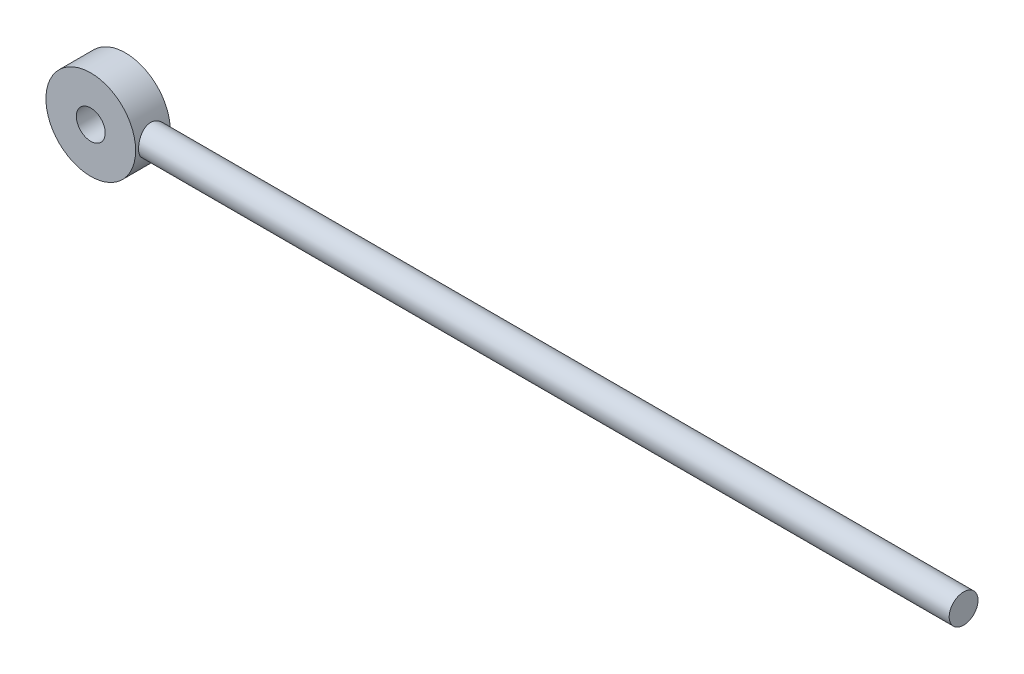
ISO-10303-21;
HEADER;
FILE_DESCRIPTION(('STEP AP214'),'2;1');
FILE_NAME('part.step','',(''),(''),'','','');
FILE_SCHEMA(('AUTOMOTIVE_DESIGN { 1 0 10303 214 1 1 1 1 }'));
ENDSEC;
DATA;
#1=APPLICATION_CONTEXT('core data for automotive mechanical design processes');
#2=APPLICATION_PROTOCOL_DEFINITION('international standard','automotive_design',2000,#1);
#3=PRODUCT_CONTEXT('',#1,'mechanical');
#4=PRODUCT('Part','Part','',(#3));
#5=PRODUCT_RELATED_PRODUCT_CATEGORY('part','',(#4));
#6=PRODUCT_DEFINITION_FORMATION('','',#4);
#7=PRODUCT_DEFINITION_CONTEXT('part definition',#1,'design');
#8=PRODUCT_DEFINITION('design','',#6,#7);
#9=PRODUCT_DEFINITION_SHAPE('','',#8);
#10=(LENGTH_UNIT() NAMED_UNIT(*) SI_UNIT(.MILLI.,.METRE.));
#11=(NAMED_UNIT(*) PLANE_ANGLE_UNIT() SI_UNIT($,.RADIAN.));
#12=(NAMED_UNIT(*) SI_UNIT($,.STERADIAN.) SOLID_ANGLE_UNIT());
#13=UNCERTAINTY_MEASURE_WITH_UNIT(LENGTH_MEASURE(1.E-05),#10,'distance_accuracy_value','');
#14=(GEOMETRIC_REPRESENTATION_CONTEXT(3) GLOBAL_UNCERTAINTY_ASSIGNED_CONTEXT((#13)) GLOBAL_UNIT_ASSIGNED_CONTEXT((#10,
#11,#12)) REPRESENTATION_CONTEXT('',''));
#15=CARTESIAN_POINT('',(0.,0.,0.));
#16=DIRECTION('',(0.,0.,1.));
#17=DIRECTION('',(1.,0.,0.));
#18=AXIS2_PLACEMENT_3D('',#15,#16,#17);
#19=CARTESIAN_POINT('',(11.6643537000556,0.,0.));
#20=DIRECTION('',(-1.,0.,0.));
#21=DIRECTION('',(0.,0.,1.));
#22=AXIS2_PLACEMENT_3D('',#19,#20,#21);
#23=CYLINDRICAL_SURFACE('',#22,3.9624);
#24=CARTESIAN_POINT('',(234.95,0.,0.));
#25=DIRECTION('',(-1.,0.,0.));
#26=DIRECTION('',(0.,0.,1.));
#27=AXIS2_PLACEMENT_3D('',#24,#25,#26);
#28=CIRCLE('',#27,3.9624);
#29=CARTESIAN_POINT('',(234.95,0.,3.9624));
#30=VERTEX_POINT('',#29);
#31=EDGE_CURVE('E41',#30,#30,#28,.T.);
#32=ORIENTED_EDGE('',*,*,#31,.T.);
#33=EDGE_LOOP('',(#32));
#34=FACE_BOUND('',#33,.T.);
#35=CARTESIAN_POINT('',(12.319,0.,3.9624));
#36=CARTESIAN_POINT('',(12.3189995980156,0.21662471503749,3.96239958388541));
#37=CARTESIAN_POINT('',(12.313232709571,0.43325527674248,3.94457743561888));
#38=CARTESIAN_POINT('',(12.2907937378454,0.860161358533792,3.8739600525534));
#39=CARTESIAN_POINT('',(12.2741197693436,1.07043577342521,3.82115877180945));
#40=CARTESIAN_POINT('',(12.2316839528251,1.47841257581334,3.68256211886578));
#41=CARTESIAN_POINT('',(12.2059366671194,1.67613451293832,3.59681959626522));
#42=CARTESIAN_POINT('',(12.1479994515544,2.05439353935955,3.39500530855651));
#43=CARTESIAN_POINT('',(12.1158083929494,2.23492760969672,3.27892822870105));
#44=CARTESIAN_POINT('',(12.0472173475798,2.57955663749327,3.01577078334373));
#45=CARTESIAN_POINT('',(12.0107216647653,2.74301482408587,2.86788156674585));
#46=CARTESIAN_POINT('',(11.938176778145,3.04328860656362,2.54701895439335));
#47=CARTESIAN_POINT('',(11.9021276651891,3.18009886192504,2.37404054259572));
#48=CARTESIAN_POINT('',(11.8335195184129,3.42672415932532,2.00230238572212));
#49=CARTESIAN_POINT('',(11.8010779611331,3.53572982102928,1.80298191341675));
#50=CARTESIAN_POINT('',(11.7448041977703,3.71840537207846,1.38762581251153));
#51=CARTESIAN_POINT('',(11.7209695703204,3.79208520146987,1.17159490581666));
#52=CARTESIAN_POINT('',(11.6856121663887,3.89966210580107,0.736160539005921));
#53=CARTESIAN_POINT('',(11.6737232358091,3.93474566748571,0.517080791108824));
#54=CARTESIAN_POINT('',(11.6625179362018,3.96784200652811,0.075846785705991));
#55=CARTESIAN_POINT('',(11.6631979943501,3.96586531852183,-0.146306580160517));
#56=CARTESIAN_POINT('',(11.6767316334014,3.92582232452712,-0.577437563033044));
#57=CARTESIAN_POINT('',(11.6890706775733,3.88928134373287,-0.786575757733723));
#58=CARTESIAN_POINT('',(11.7236934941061,3.78362669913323,-1.19557893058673));
#59=CARTESIAN_POINT('',(11.7459783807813,3.71450938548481,-1.39544286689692));
#60=CARTESIAN_POINT('',(11.7983642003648,3.54462120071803,-1.78378485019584));
#61=CARTESIAN_POINT('',(11.8285792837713,3.44338311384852,-1.97204244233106));
#62=CARTESIAN_POINT('',(11.8933706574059,3.21245154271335,-2.32938988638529));
#63=CARTESIAN_POINT('',(11.9279481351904,3.08275030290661,-2.49847449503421));
#64=CARTESIAN_POINT('',(11.9996152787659,2.79115800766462,-2.8212774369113));
#65=CARTESIAN_POINT('',(12.0367455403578,2.62801293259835,-2.97385616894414));
#66=CARTESIAN_POINT('',(12.1078640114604,2.27799089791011,-3.24977472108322));
#67=CARTESIAN_POINT('',(12.1418519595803,2.09111196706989,-3.37311211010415));
#68=CARTESIAN_POINT('',(12.2032504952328,1.69663571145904,-3.58788106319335));
#69=CARTESIAN_POINT('',(12.2306014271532,1.48887262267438,-3.67902637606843));
#70=CARTESIAN_POINT('',(12.2752126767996,1.05987592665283,-3.82472841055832));
#71=CARTESIAN_POINT('',(12.292476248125,0.838646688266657,-3.87929693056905));
#72=CARTESIAN_POINT('',(12.3144374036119,0.398659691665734,-3.94832165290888));
#73=CARTESIAN_POINT('',(12.3196176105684,0.18016750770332,-3.96431934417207));
#74=CARTESIAN_POINT('',(12.3182644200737,-0.256410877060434,-3.96011388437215));
#75=CARTESIAN_POINT('',(12.311732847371,-0.474497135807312,-3.93991637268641));
#76=CARTESIAN_POINT('',(12.2880078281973,-0.898030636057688,-3.86512397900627));
#77=CARTESIAN_POINT('',(12.271102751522,-1.10365977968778,-3.81145881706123));
#78=CARTESIAN_POINT('',(12.2286267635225,-1.50292758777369,-3.67240097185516));
#79=CARTESIAN_POINT('',(12.2030547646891,-1.69656474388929,-3.58700430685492));
#80=CARTESIAN_POINT('',(12.1450566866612,-2.07179520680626,-3.384505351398));
#81=CARTESIAN_POINT('',(12.1124738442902,-2.25296094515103,-3.26665693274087));
#82=CARTESIAN_POINT('',(12.0441668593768,-2.59345566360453,-3.00348669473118));
#83=CARTESIAN_POINT('',(12.0084418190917,-2.75277836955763,-2.85815701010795));
#84=CARTESIAN_POINT('',(11.9359764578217,-3.05204035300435,-2.53689772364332));
#85=CARTESIAN_POINT('',(11.8992567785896,-3.1908801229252,-2.35993684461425));
#86=CARTESIAN_POINT('',(11.8305165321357,-3.43700812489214,-1.98443335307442));
#87=CARTESIAN_POINT('',(11.7984959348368,-3.54429655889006,-1.78589087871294));
#88=CARTESIAN_POINT('',(11.7431190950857,-3.72367465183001,-1.3730725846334));
#89=CARTESIAN_POINT('',(11.7197356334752,-3.79587511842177,-1.1588487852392));
#90=CARTESIAN_POINT('',(11.6845385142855,-3.90289072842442,-0.720369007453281));
#91=CARTESIAN_POINT('',(11.6727201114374,-3.93772120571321,-0.496117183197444));
#92=CARTESIAN_POINT('',(11.6625054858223,-3.96786495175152,-0.0554969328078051));
#93=CARTESIAN_POINT('',(11.6634935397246,-3.96499093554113,0.160734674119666));
#94=CARTESIAN_POINT('',(11.6772732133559,-3.92422013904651,0.58946773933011));
#95=CARTESIAN_POINT('',(11.690064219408,-3.88632517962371,0.801969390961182));
#96=CARTESIAN_POINT('',(11.725565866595,-3.77783258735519,1.21375687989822));
#97=CARTESIAN_POINT('',(11.7481098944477,-3.70778308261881,1.41320259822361));
#98=CARTESIAN_POINT('',(11.8005264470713,-3.53740638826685,1.79766715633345));
#99=CARTESIAN_POINT('',(11.830400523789,-3.43707278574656,1.98268293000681));
#100=CARTESIAN_POINT('',(11.8956426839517,-3.20415737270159,2.34127256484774));
#101=CARTESIAN_POINT('',(11.9311861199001,-3.07041954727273,2.51406352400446));
#102=CARTESIAN_POINT('',(12.0029876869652,-2.77649144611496,2.83533708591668));
#103=CARTESIAN_POINT('',(12.039246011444,-2.616293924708,2.98381300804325));
#104=CARTESIAN_POINT('',(12.1099292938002,-2.26718953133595,3.25750916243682));
#105=CARTESIAN_POINT('',(12.1442442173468,-2.07746830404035,3.38172241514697));
#106=CARTESIAN_POINT('',(12.2057444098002,-1.67873961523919,3.59634014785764));
#107=CARTESIAN_POINT('',(12.2329320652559,-1.46973864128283,3.68675594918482));
#108=CARTESIAN_POINT('',(12.2755869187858,-1.05290948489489,3.82582915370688));
#109=CARTESIAN_POINT('',(12.2917201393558,-0.845950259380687,3.87688875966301));
#110=CARTESIAN_POINT('',(12.3134256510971,-0.425994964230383,3.94517045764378));
#111=CARTESIAN_POINT('',(12.3190003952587,-0.213000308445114,3.96240040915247));
#112=CARTESIAN_POINT('',(12.319,0.,3.9624));
#113=B_SPLINE_CURVE_WITH_KNOTS('',3,(#35,#36,#37,#38,#39,#40,#41,#42,#43,#44,#45,#46,#47,#48,
#49,#50,#51,#52,#53,#54,#55,#56,#57,#58,#59,#60,#61,#62,#63,#64,#65,#66,#67,#68,#69,#70,#71,#72,
#73,#74,#75,#76,#77,#78,#79,#80,#81,#82,#83,#84,#85,#86,#87,#88,#89,#90,#91,#92,#93,#94,#95,#96,
#97,#98,#99,#100,#101,#102,#103,#104,#105,#106,#107,#108,#109,#110,#111,#112),.UNSPECIFIED.,.T.,
.F.,(4,2,2,2,2,2,2,2,2,2,2,2,2,2,2,2,2,2,2,2,2,2,2,2,2,2,2,2,2,2,2,2,2,2,2,2,2,2,4),(0.,
0.649090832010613,1.29829388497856,1.94645970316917,2.5947391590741,3.26201603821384,
3.92942650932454,4.61448304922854,5.29934671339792,5.9625116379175,6.62548805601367,
7.26050838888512,7.89559988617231,8.54038884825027,9.18535371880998,9.86153047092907,
10.5377634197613,11.2198663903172,11.9017492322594,12.5558926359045,13.2099341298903,
13.8465696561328,14.4832850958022,15.1360777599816,15.7890575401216,16.4695492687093,
17.1500366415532,17.8283608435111,18.5064066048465,19.1519785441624,19.7975169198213,
20.4324378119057,21.0674932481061,21.7286520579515,22.3899922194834,23.0746980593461,
23.75917433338,24.3975533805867,25.0357840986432),.UNSPECIFIED.);
#114=CARTESIAN_POINT('',(12.319,0.,3.9624));
#115=VERTEX_POINT('',#114);
#116=EDGE_CURVE('E10',#115,#115,#113,.T.);
#117=ORIENTED_EDGE('',*,*,#116,.F.);
#118=EDGE_LOOP('',(#117));
#119=FACE_BOUND('',#118,.T.);
#120=ADVANCED_FACE('F31',(#34,#119),#23,.T.);
#121=CARTESIAN_POINT('',(234.95,3.9624,0.));
#122=DIRECTION('',(-1.,0.,0.));
#123=DIRECTION('',(0.,0.,1.));
#124=AXIS2_PLACEMENT_3D('',#121,#122,#123);
#125=PLANE('',#124);
#126=ORIENTED_EDGE('',*,*,#31,.F.);
#127=EDGE_LOOP('',(#126));
#128=FACE_BOUND('',#127,.T.);
#129=ADVANCED_FACE('F33',(#128),#125,.F.);
#130=CARTESIAN_POINT('',(0.,0.,4.7625));
#131=DIRECTION('',(0.,0.,-1.));
#132=DIRECTION('',(-1.,0.,0.));
#133=AXIS2_PLACEMENT_3D('',#130,#131,#132);
#134=CYLINDRICAL_SURFACE('',#133,12.319);
#135=CARTESIAN_POINT('',(0.,0.,-4.7625));
#136=DIRECTION('',(0.,0.,1.));
#137=DIRECTION('',(1.,0.,0.));
#138=AXIS2_PLACEMENT_3D('',#135,#136,#137);
#139=CIRCLE('',#138,12.319);
#140=CARTESIAN_POINT('',(12.319,0.,-4.7625));
#141=VERTEX_POINT('',#140);
#142=EDGE_CURVE('E49',#141,#141,#139,.T.);
#143=ORIENTED_EDGE('',*,*,#142,.T.);
#144=EDGE_LOOP('',(#143));
#145=FACE_BOUND('',#144,.T.);
#146=CARTESIAN_POINT('',(0.,0.,4.7625));
#147=DIRECTION('',(0.,0.,1.));
#148=DIRECTION('',(1.,0.,0.));
#149=AXIS2_PLACEMENT_3D('',#146,#147,#148);
#150=CIRCLE('',#149,12.319);
#151=CARTESIAN_POINT('',(12.319,0.,4.7625));
#152=VERTEX_POINT('',#151);
#153=EDGE_CURVE('E45',#152,#152,#150,.T.);
#154=ORIENTED_EDGE('',*,*,#153,.F.);
#155=EDGE_LOOP('',(#154));
#156=FACE_BOUND('',#155,.T.);
#157=ORIENTED_EDGE('',*,*,#116,.T.);
#158=EDGE_LOOP('',(#157));
#159=FACE_BOUND('',#158,.T.);
#160=ADVANCED_FACE('F67',(#145,#156,#159),#134,.T.);
#161=CARTESIAN_POINT('',(0.,0.,4.7625));
#162=DIRECTION('',(0.,0.,1.));
#163=DIRECTION('',(1.,0.,0.));
#164=AXIS2_PLACEMENT_3D('',#161,#162,#163);
#165=PLANE('',#164);
#166=ORIENTED_EDGE('',*,*,#153,.T.);
#167=EDGE_LOOP('',(#166));
#168=FACE_BOUND('',#167,.T.);
#169=CARTESIAN_POINT('',(0.,0.,4.7625));
#170=DIRECTION('',(0.,0.,1.));
#171=DIRECTION('',(1.,0.,0.));
#172=AXIS2_PLACEMENT_3D('',#169,#170,#171);
#173=CIRCLE('',#172,3.9624);
#174=CARTESIAN_POINT('',(-3.9624,0.,4.7625));
#175=VERTEX_POINT('',#174);
#176=EDGE_CURVE('E53',#175,#175,#173,.T.);
#177=ORIENTED_EDGE('',*,*,#176,.F.);
#178=EDGE_LOOP('',(#177));
#179=FACE_BOUND('',#178,.T.);
#180=ADVANCED_FACE('F64',(#168,#179),#165,.T.);
#181=CARTESIAN_POINT('',(0.,0.,-4.7625));
#182=DIRECTION('',(0.,0.,1.));
#183=DIRECTION('',(1.,0.,0.));
#184=AXIS2_PLACEMENT_3D('',#181,#182,#183);
#185=PLANE('',#184);
#186=ORIENTED_EDGE('',*,*,#142,.F.);
#187=EDGE_LOOP('',(#186));
#188=FACE_BOUND('',#187,.T.);
#189=CARTESIAN_POINT('',(0.,0.,-4.7625));
#190=DIRECTION('',(0.,0.,1.));
#191=DIRECTION('',(1.,0.,0.));
#192=AXIS2_PLACEMENT_3D('',#189,#190,#191);
#193=CIRCLE('',#192,3.9624);
#194=CARTESIAN_POINT('',(-3.9624,0.,-4.7625));
#195=VERTEX_POINT('',#194);
#196=EDGE_CURVE('E55',#195,#195,#193,.T.);
#197=ORIENTED_EDGE('',*,*,#196,.T.);
#198=EDGE_LOOP('',(#197));
#199=FACE_BOUND('',#198,.T.);
#200=ADVANCED_FACE('F66',(#188,#199),#185,.F.);
#201=CARTESIAN_POINT('',(0.,0.,4.7625));
#202=DIRECTION('',(0.,0.,-1.));
#203=DIRECTION('',(-1.,0.,0.));
#204=AXIS2_PLACEMENT_3D('',#201,#202,#203);
#205=CYLINDRICAL_SURFACE('',#204,3.9624);
#206=CARTESIAN_POINT('',(-3.9624,0.,4.7625));
#207=CARTESIAN_POINT('',(-3.9624,0.,4.66328125));
#208=CARTESIAN_POINT('',(-3.9624,0.,4.5640625));
#209=CARTESIAN_POINT('',(-3.9624,0.,4.365625));
#210=CARTESIAN_POINT('',(-3.9624,0.,4.26640625));
#211=CARTESIAN_POINT('',(-3.9624,0.,4.06796875));
#212=CARTESIAN_POINT('',(-3.9624,0.,3.96875));
#213=CARTESIAN_POINT('',(-3.9624,0.,3.7703125));
#214=CARTESIAN_POINT('',(-3.9624,0.,3.67109375));
#215=CARTESIAN_POINT('',(-3.9624,0.,3.47265625));
#216=CARTESIAN_POINT('',(-3.9624,0.,3.3734375));
#217=CARTESIAN_POINT('',(-3.9624,0.,3.175));
#218=CARTESIAN_POINT('',(-3.9624,0.,3.07578125));
#219=CARTESIAN_POINT('',(-3.9624,0.,2.87734375));
#220=CARTESIAN_POINT('',(-3.9624,0.,2.778125));
#221=CARTESIAN_POINT('',(-3.9624,0.,2.5796875));
#222=CARTESIAN_POINT('',(-3.9624,0.,2.48046875));
#223=CARTESIAN_POINT('',(-3.9624,0.,2.28203125));
#224=CARTESIAN_POINT('',(-3.9624,0.,2.1828125));
#225=CARTESIAN_POINT('',(-3.9624,0.,1.984375));
#226=CARTESIAN_POINT('',(-3.9624,0.,1.88515625));
#227=CARTESIAN_POINT('',(-3.9624,0.,1.68671875));
#228=CARTESIAN_POINT('',(-3.9624,0.,1.5875));
#229=CARTESIAN_POINT('',(-3.9624,0.,1.3890625));
#230=CARTESIAN_POINT('',(-3.9624,0.,1.28984375));
#231=CARTESIAN_POINT('',(-3.9624,0.,1.09140625));
#232=CARTESIAN_POINT('',(-3.9624,0.,0.992187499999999));
#233=CARTESIAN_POINT('',(-3.9624,0.,0.793749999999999));
#234=CARTESIAN_POINT('',(-3.9624,0.,0.694531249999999));
#235=CARTESIAN_POINT('',(-3.9624,0.,0.496093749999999));
#236=CARTESIAN_POINT('',(-3.9624,0.,0.396874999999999));
#237=CARTESIAN_POINT('',(-3.9624,0.,0.198437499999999));
#238=CARTESIAN_POINT('',(-3.9624,0.,0.0992187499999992));
#239=CARTESIAN_POINT('',(-3.9624,0.,-0.0992187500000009));
#240=CARTESIAN_POINT('',(-3.9624,0.,-0.198437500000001));
#241=CARTESIAN_POINT('',(-3.9624,0.,-0.396875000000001));
#242=CARTESIAN_POINT('',(-3.9624,0.,-0.496093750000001));
#243=CARTESIAN_POINT('',(-3.9624,0.,-0.694531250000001));
#244=CARTESIAN_POINT('',(-3.9624,0.,-0.793750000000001));
#245=CARTESIAN_POINT('',(-3.9624,0.,-0.992187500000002));
#246=CARTESIAN_POINT('',(-3.9624,0.,-1.09140625));
#247=CARTESIAN_POINT('',(-3.9624,0.,-1.28984375));
#248=CARTESIAN_POINT('',(-3.9624,0.,-1.3890625));
#249=CARTESIAN_POINT('',(-3.9624,0.,-1.5875));
#250=CARTESIAN_POINT('',(-3.9624,0.,-1.68671875));
#251=CARTESIAN_POINT('',(-3.9624,0.,-1.88515625));
#252=CARTESIAN_POINT('',(-3.9624,0.,-1.984375));
#253=CARTESIAN_POINT('',(-3.9624,0.,-2.1828125));
#254=CARTESIAN_POINT('',(-3.9624,0.,-2.28203125));
#255=CARTESIAN_POINT('',(-3.9624,0.,-2.48046875));
#256=CARTESIAN_POINT('',(-3.9624,0.,-2.5796875));
#257=CARTESIAN_POINT('',(-3.9624,0.,-2.778125));
#258=CARTESIAN_POINT('',(-3.9624,0.,-2.87734375));
#259=CARTESIAN_POINT('',(-3.9624,0.,-3.07578125));
#260=CARTESIAN_POINT('',(-3.9624,0.,-3.175));
#261=CARTESIAN_POINT('',(-3.9624,0.,-3.3734375));
#262=CARTESIAN_POINT('',(-3.9624,0.,-3.47265625));
#263=CARTESIAN_POINT('',(-3.9624,0.,-3.67109375));
#264=CARTESIAN_POINT('',(-3.9624,0.,-3.7703125));
#265=CARTESIAN_POINT('',(-3.9624,0.,-3.96875));
#266=CARTESIAN_POINT('',(-3.9624,0.,-4.06796875));
#267=CARTESIAN_POINT('',(-3.9624,0.,-4.26640625));
#268=CARTESIAN_POINT('',(-3.9624,0.,-4.365625));
#269=CARTESIAN_POINT('',(-3.9624,0.,-4.5640625));
#270=CARTESIAN_POINT('',(-3.9624,0.,-4.66328125));
#271=CARTESIAN_POINT('',(-3.9624,0.,-4.7625));
#272=B_SPLINE_CURVE_WITH_KNOTS('',3,(#206,#207,#208,#209,#210,#211,#212,#213,#214,#215,#216,
#217,#218,#219,#220,#221,#222,#223,#224,#225,#226,#227,#228,#229,#230,#231,#232,#233,#234,#235,
#236,#237,#238,#239,#240,#241,#242,#243,#244,#245,#246,#247,#248,#249,#250,#251,#252,#253,#254,
#255,#256,#257,#258,#259,#260,#261,#262,#263,#264,#265,#266,#267,#268,#269,#270,#271),
.UNSPECIFIED.,.F.,.F.,(4,2,2,2,2,2,2,2,2,2,2,2,2,2,2,2,2,2,2,2,2,2,2,2,2,2,2,2,2,2,2,2,4),(0.,
0.297656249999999,0.595312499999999,0.89296875,1.190625,1.48828125,1.7859375,2.08359375,2.38125,
2.67890625,2.9765625,3.27421875,3.571875,3.86953125,4.1671875,4.46484375,4.7625,5.06015625,
5.3578125,5.65546875,5.953125,6.25078125,6.5484375,6.84609375,7.14375,7.44140625,7.7390625,
8.03671875,8.334375,8.63203125,8.9296875,9.22734375,9.525),.UNSPECIFIED.);
#273=EDGE_CURVE('BSEAM61',#175,#195,#272,.T.);
#274=ORIENTED_EDGE('',*,*,#176,.T.);
#275=ORIENTED_EDGE('',*,*,#196,.F.);
#276=ORIENTED_EDGE('',*,*,#273,.T.);
#277=ORIENTED_EDGE('',*,*,#273,.F.);
#278=EDGE_LOOP('',(#274,#276,#275,#277));
#279=FACE_BOUND('',#278,.T.);
#280=ADVANCED_FACE('F61',(#279),#205,.F.);
#281=CLOSED_SHELL('',(#120,#129,#160,#180,#200,#280));
#282=MANIFOLD_SOLID_BREP('B2',#281);
#283=ADVANCED_BREP_SHAPE_REPRESENTATION('',(#18,#282),#14);
#284=SHAPE_DEFINITION_REPRESENTATION(#9,#283);
ENDSEC;
END-ISO-10303-21;
